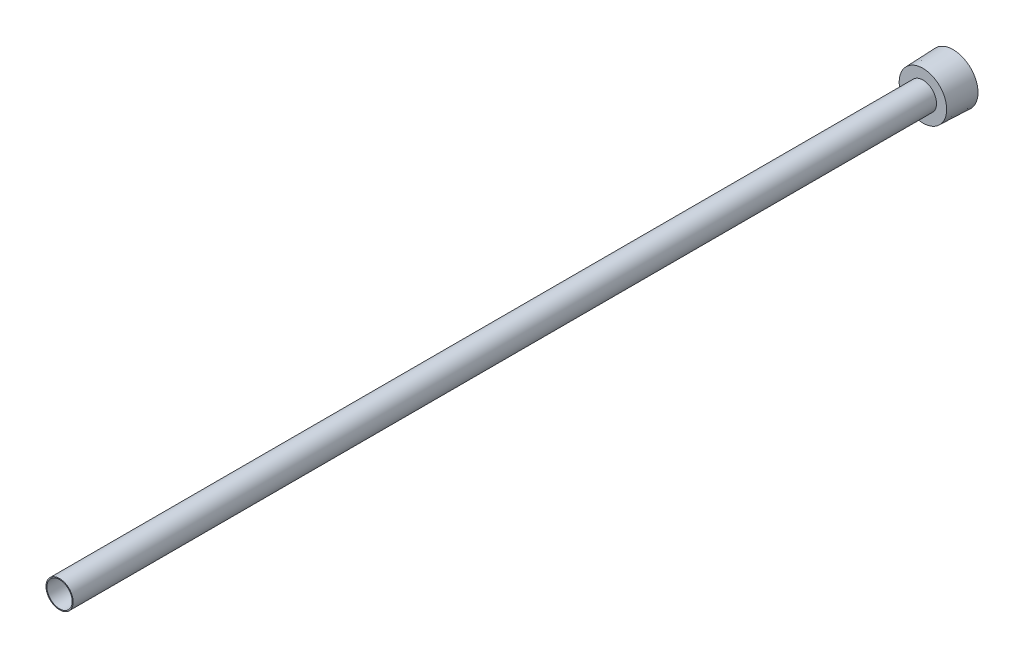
from build123d import *

# Parameters (mm, degrees)
SKETCH2_R          = 4.318
CUT_EXTRUDE1_DEPTH = 306.035329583
CUT_EXTRUDE2_DEPTH = 6.35


with BuildPart() as part:
    # Sketch1 → Revolve1 (revolve)
    with BuildSketch(Plane(origin=(0, 0, 0), x_dir=(0, 0, -1), z_dir=(1, 0, 0)), mode=Mode.PRIVATE) as revolve1_sk:
        Polygon((0, 0), (0, 8.4709), (-10.3124, 8.094743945), (-10.3124, 4.6355), (-304.8, 4.6355), (-304.8, 0), align=None)
    revolve(revolve1_sk.sketch.rotate(Axis((0, 0, 168.793426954), (0, 0, -1)), 90), axis=Axis((0, 0, 168.793426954), (0, 0, -1)))

    # Sketch2 → Cut-Extrude1 (cut, through all)
    with BuildSketch(Plane.XY.offset(304.8)):
        Circle(SKETCH2_R)
    extrude(amount=-CUT_EXTRUDE1_DEPTH, mode=Mode.SUBTRACT)

    # Sketch3 → Cut-Extrude2 (cut)
    with BuildSketch(Plane(origin=(0, 0, 0), x_dir=(-1, 0, 0), z_dir=(0, 0, -1))):
        Polygon((0, -5.499261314), (4.7625, -2.749630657), (4.7625, 2.749630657), (0, 5.499261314), (-4.7625, 2.749630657), (-4.7625, -2.749630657), align=None)
    extrude(amount=-CUT_EXTRUDE2_DEPTH, mode=Mode.SUBTRACT)


solid = part.part
